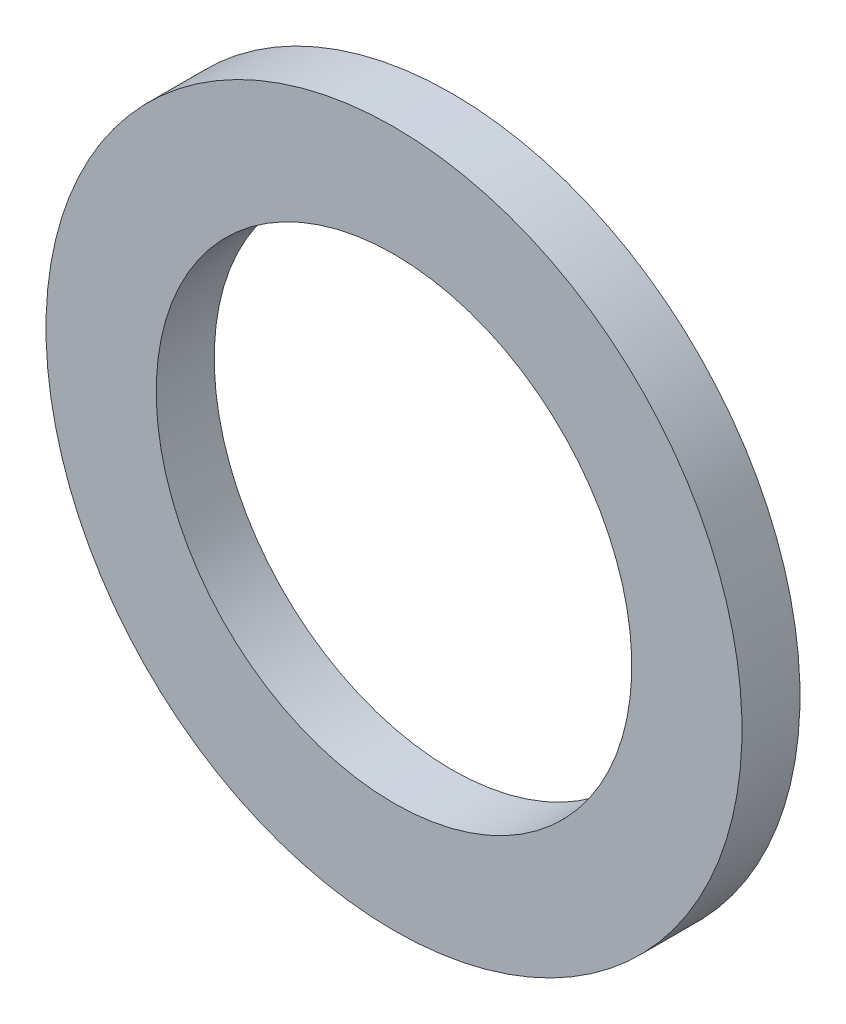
ISO-10303-21;
HEADER;
FILE_DESCRIPTION(('STEP AP214'),'2;1');
FILE_NAME('part.step','',(''),(''),'','','');
FILE_SCHEMA(('AUTOMOTIVE_DESIGN { 1 0 10303 214 1 1 1 1 }'));
ENDSEC;
DATA;
#1=APPLICATION_CONTEXT('core data for automotive mechanical design processes');
#2=APPLICATION_PROTOCOL_DEFINITION('international standard','automotive_design',2000,#1);
#3=PRODUCT_CONTEXT('',#1,'mechanical');
#4=PRODUCT('Part','Part','',(#3));
#5=PRODUCT_RELATED_PRODUCT_CATEGORY('part','',(#4));
#6=PRODUCT_DEFINITION_FORMATION('','',#4);
#7=PRODUCT_DEFINITION_CONTEXT('part definition',#1,'design');
#8=PRODUCT_DEFINITION('design','',#6,#7);
#9=PRODUCT_DEFINITION_SHAPE('','',#8);
#10=(LENGTH_UNIT() NAMED_UNIT(*) SI_UNIT(.MILLI.,.METRE.));
#11=(NAMED_UNIT(*) PLANE_ANGLE_UNIT() SI_UNIT($,.RADIAN.));
#12=(NAMED_UNIT(*) SI_UNIT($,.STERADIAN.) SOLID_ANGLE_UNIT());
#13=UNCERTAINTY_MEASURE_WITH_UNIT(LENGTH_MEASURE(1.E-05),#10,'distance_accuracy_value','');
#14=(GEOMETRIC_REPRESENTATION_CONTEXT(3) GLOBAL_UNCERTAINTY_ASSIGNED_CONTEXT((#13)) GLOBAL_UNIT_ASSIGNED_CONTEXT((#10,
#11,#12)) REPRESENTATION_CONTEXT('',''));
#15=CARTESIAN_POINT('',(0.,0.,0.));
#16=DIRECTION('',(0.,0.,1.));
#17=DIRECTION('',(1.,0.,0.));
#18=AXIS2_PLACEMENT_3D('',#15,#16,#17);
#19=CARTESIAN_POINT('',(0.,0.,0.));
#20=DIRECTION('',(0.,0.,1.));
#21=DIRECTION('',(0.,-1.,0.));
#22=AXIS2_PLACEMENT_3D('',#19,#20,#21);
#23=PLANE('',#22);
#24=CARTESIAN_POINT('',(0.,0.,0.));
#25=DIRECTION('',(0.,0.,1.));
#26=DIRECTION('',(0.,-1.,0.));
#27=AXIS2_PLACEMENT_3D('',#24,#25,#26);
#28=CIRCLE('',#27,6.);
#29=CARTESIAN_POINT('',(0.,-6.,0.));
#30=VERTEX_POINT('',#29);
#31=EDGE_CURVE('E26',#30,#30,#28,.T.);
#32=ORIENTED_EDGE('',*,*,#31,.F.);
#33=EDGE_LOOP('',(#32));
#34=FACE_BOUND('',#33,.T.);
#35=CARTESIAN_POINT('',(0.,0.,0.));
#36=DIRECTION('',(0.,0.,1.));
#37=DIRECTION('',(0.,-1.,0.));
#38=AXIS2_PLACEMENT_3D('',#35,#36,#37);
#39=CIRCLE('',#38,4.1);
#40=CARTESIAN_POINT('',(0.,-4.1,0.));
#41=VERTEX_POINT('',#40);
#42=EDGE_CURVE('E17',#41,#41,#39,.T.);
#43=ORIENTED_EDGE('',*,*,#42,.T.);
#44=EDGE_LOOP('',(#43));
#45=FACE_BOUND('',#44,.T.);
#46=ADVANCED_FACE('F14',(#34,#45),#23,.F.);
#47=CARTESIAN_POINT('',(0.,0.,0.));
#48=DIRECTION('',(0.,0.,1.));
#49=DIRECTION('',(0.,-1.,0.));
#50=AXIS2_PLACEMENT_3D('',#47,#48,#49);
#51=CYLINDRICAL_SURFACE('',#50,4.1);
#52=ORIENTED_EDGE('',*,*,#42,.F.);
#53=EDGE_LOOP('',(#52));
#54=FACE_BOUND('',#53,.T.);
#55=CARTESIAN_POINT('',(0.,0.,1.));
#56=DIRECTION('',(0.,0.,1.));
#57=DIRECTION('',(0.,-1.,0.));
#58=AXIS2_PLACEMENT_3D('',#55,#56,#57);
#59=CIRCLE('',#58,4.1);
#60=CARTESIAN_POINT('',(0.,-4.1,1.));
#61=VERTEX_POINT('',#60);
#62=EDGE_CURVE('E21',#61,#61,#59,.F.);
#63=ORIENTED_EDGE('',*,*,#62,.F.);
#64=EDGE_LOOP('',(#63));
#65=FACE_BOUND('',#64,.T.);
#66=ADVANCED_FACE('F35',(#54,#65),#51,.F.);
#67=CARTESIAN_POINT('',(0.,0.,0.));
#68=DIRECTION('',(0.,0.,1.));
#69=DIRECTION('',(0.,-1.,0.));
#70=AXIS2_PLACEMENT_3D('',#67,#68,#69);
#71=CYLINDRICAL_SURFACE('',#70,6.);
#72=CARTESIAN_POINT('',(0.,0.,1.));
#73=DIRECTION('',(0.,0.,1.));
#74=DIRECTION('',(0.,-1.,0.));
#75=AXIS2_PLACEMENT_3D('',#72,#73,#74);
#76=CIRCLE('',#75,6.);
#77=CARTESIAN_POINT('',(0.,-6.,1.));
#78=VERTEX_POINT('',#77);
#79=EDGE_CURVE('E10',#78,#78,#76,.T.);
#80=ORIENTED_EDGE('',*,*,#79,.F.);
#81=EDGE_LOOP('',(#80));
#82=FACE_BOUND('',#81,.T.);
#83=ORIENTED_EDGE('',*,*,#31,.T.);
#84=EDGE_LOOP('',(#83));
#85=FACE_BOUND('',#84,.T.);
#86=ADVANCED_FACE('F38',(#82,#85),#71,.T.);
#87=CARTESIAN_POINT('',(0.,0.,1.));
#88=DIRECTION('',(0.,0.,1.));
#89=DIRECTION('',(0.,-1.,0.));
#90=AXIS2_PLACEMENT_3D('',#87,#88,#89);
#91=PLANE('',#90);
#92=ORIENTED_EDGE('',*,*,#79,.T.);
#93=EDGE_LOOP('',(#92));
#94=FACE_BOUND('',#93,.T.);
#95=ORIENTED_EDGE('',*,*,#62,.T.);
#96=EDGE_LOOP('',(#95));
#97=FACE_BOUND('',#96,.T.);
#98=ADVANCED_FACE('F41',(#94,#97),#91,.T.);
#99=CLOSED_SHELL('',(#46,#66,#86,#98));
#100=MANIFOLD_SOLID_BREP('B1',#99);
#101=ADVANCED_BREP_SHAPE_REPRESENTATION('',(#18,#100),#14);
#102=SHAPE_DEFINITION_REPRESENTATION(#9,#101);
ENDSEC;
END-ISO-10303-21;
